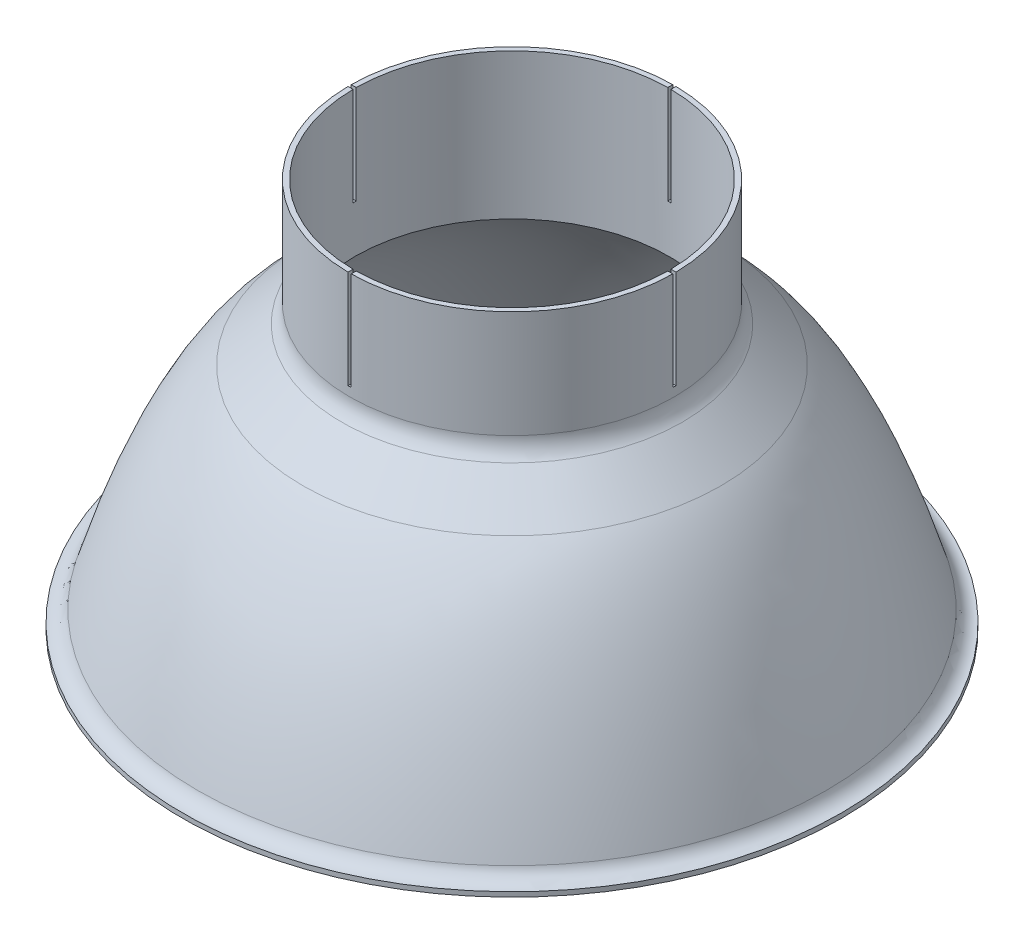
ISO-10303-21;
HEADER;
FILE_DESCRIPTION(('STEP AP214'),'2;1');
FILE_NAME('part.step','',(''),(''),'','','');
FILE_SCHEMA(('AUTOMOTIVE_DESIGN { 1 0 10303 214 1 1 1 1 }'));
ENDSEC;
DATA;
#1=APPLICATION_CONTEXT('core data for automotive mechanical design processes');
#2=APPLICATION_PROTOCOL_DEFINITION('international standard','automotive_design',2000,#1);
#3=PRODUCT_CONTEXT('',#1,'mechanical');
#4=PRODUCT('Part','Part','',(#3));
#5=PRODUCT_RELATED_PRODUCT_CATEGORY('part','',(#4));
#6=PRODUCT_DEFINITION_FORMATION('','',#4);
#7=PRODUCT_DEFINITION_CONTEXT('part definition',#1,'design');
#8=PRODUCT_DEFINITION('design','',#6,#7);
#9=PRODUCT_DEFINITION_SHAPE('','',#8);
#10=(LENGTH_UNIT() NAMED_UNIT(*) SI_UNIT(.MILLI.,.METRE.));
#11=(NAMED_UNIT(*) PLANE_ANGLE_UNIT() SI_UNIT($,.RADIAN.));
#12=(NAMED_UNIT(*) SI_UNIT($,.STERADIAN.) SOLID_ANGLE_UNIT());
#13=UNCERTAINTY_MEASURE_WITH_UNIT(LENGTH_MEASURE(1.E-05),#10,'distance_accuracy_value','');
#14=(GEOMETRIC_REPRESENTATION_CONTEXT(3) GLOBAL_UNCERTAINTY_ASSIGNED_CONTEXT((#13)) GLOBAL_UNIT_ASSIGNED_CONTEXT((#10,
#11,#12)) REPRESENTATION_CONTEXT('',''));
#15=CARTESIAN_POINT('',(0.,0.,0.));
#16=DIRECTION('',(0.,0.,1.));
#17=DIRECTION('',(1.,0.,0.));
#18=AXIS2_PLACEMENT_3D('',#15,#16,#17);
#19=CARTESIAN_POINT('',(50.8000000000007,27.1785255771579,0.));
#20=DIRECTION('',(0.,-1.,0.));
#21=DIRECTION('',(1.,0.,0.));
#22=AXIS2_PLACEMENT_3D('',#19,#20,#21);
#23=PLANE('',#22);
#24=CARTESIAN_POINT('',(0.,27.1785255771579,0.));
#25=DIRECTION('',(0.,1.,0.));
#26=DIRECTION('',(-1.,0.,0.));
#27=AXIS2_PLACEMENT_3D('',#24,#25,#26);
#28=CIRCLE('',#27,50.8000000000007);
#29=CARTESIAN_POINT('',(-50.7974599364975,27.1785255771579,0.507999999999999));
#30=VERTEX_POINT('',#29);
#31=CARTESIAN_POINT('',(-0.508000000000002,27.1785255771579,50.7974599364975));
#32=VERTEX_POINT('',#31);
#33=EDGE_CURVE('E235',#30,#32,#28,.T.);
#34=ORIENTED_EDGE('',*,*,#33,.F.);
#35=DIRECTION('',(-1.,0.,0.));
#36=VECTOR('',#35,1.);
#37=CARTESIAN_POINT('',(50.8000000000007,27.1785255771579,0.507999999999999));
#38=LINE('',#37,#36);
#39=CARTESIAN_POINT('',(-52.4231387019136,27.1785255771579,0.508000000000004));
#40=VERTEX_POINT('',#39);
#41=EDGE_CURVE('E184',#30,#40,#38,.T.);
#42=ORIENTED_EDGE('',*,*,#41,.T.);
#43=CARTESIAN_POINT('',(0.,27.1785255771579,0.));
#44=DIRECTION('',(0.,1.,0.));
#45=DIRECTION('',(-1.,0.,0.));
#46=AXIS2_PLACEMENT_3D('',#43,#44,#45);
#47=CIRCLE('',#46,52.4256000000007);
#48=CARTESIAN_POINT('',(-0.508000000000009,27.1785255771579,52.4231387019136));
#49=VERTEX_POINT('',#48);
#50=EDGE_CURVE('E244',#40,#49,#47,.T.);
#51=ORIENTED_EDGE('',*,*,#50,.T.);
#52=DIRECTION('',(0.,0.,-1.));
#53=VECTOR('',#52,1.);
#54=CARTESIAN_POINT('',(-0.508000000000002,27.1785255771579,0.));
#55=LINE('',#54,#53);
#56=EDGE_CURVE('E230',#49,#32,#55,.T.);
#57=ORIENTED_EDGE('',*,*,#56,.T.);
#58=EDGE_LOOP('',(#34,#42,#51,#57));
#59=FACE_BOUND('',#58,.T.);
#60=ADVANCED_FACE('F42',(#59),#23,.F.);
#61=CARTESIAN_POINT('',(0.508000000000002,27.1785255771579,52.4231387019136));
#62=VERTEX_POINT('',#61);
#63=CARTESIAN_POINT('',(52.4231387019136,27.1785255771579,0.508000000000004));
#64=VERTEX_POINT('',#63);
#65=EDGE_CURVE('E245',#62,#64,#47,.T.);
#66=ORIENTED_EDGE('',*,*,#65,.T.);
#67=DIRECTION('',(-1.,0.,0.));
#68=VECTOR('',#67,1.);
#69=CARTESIAN_POINT('',(50.8000000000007,27.1785255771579,0.507999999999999));
#70=LINE('',#69,#68);
#71=CARTESIAN_POINT('',(50.7974599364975,27.1785255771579,0.507999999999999));
#72=VERTEX_POINT('',#71);
#73=EDGE_CURVE('E199',#64,#72,#70,.T.);
#74=ORIENTED_EDGE('',*,*,#73,.T.);
#75=CARTESIAN_POINT('',(0.508000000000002,27.1785255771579,50.7974599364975));
#76=VERTEX_POINT('',#75);
#77=EDGE_CURVE('E239',#76,#72,#28,.T.);
#78=ORIENTED_EDGE('',*,*,#77,.F.);
#79=DIRECTION('',(0.,0.,1.));
#80=VECTOR('',#79,1.);
#81=CARTESIAN_POINT('',(0.508000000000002,27.1785255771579,0.));
#82=LINE('',#81,#80);
#83=EDGE_CURVE('E216',#76,#62,#82,.T.);
#84=ORIENTED_EDGE('',*,*,#83,.T.);
#85=EDGE_LOOP('',(#66,#74,#78,#84));
#86=FACE_BOUND('',#85,.T.);
#87=ADVANCED_FACE('F273',(#86),#23,.F.);
#88=CARTESIAN_POINT('',(-0.508000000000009,27.1785255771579,-52.4231387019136));
#89=VERTEX_POINT('',#88);
#90=CARTESIAN_POINT('',(-52.4231387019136,27.1785255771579,-0.508000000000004));
#91=VERTEX_POINT('',#90);
#92=EDGE_CURVE('E240',#89,#91,#47,.T.);
#93=ORIENTED_EDGE('',*,*,#92,.T.);
#94=DIRECTION('',(1.,0.,0.));
#95=VECTOR('',#94,1.);
#96=CARTESIAN_POINT('',(50.8000000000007,27.1785255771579,-0.507999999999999));
#97=LINE('',#96,#95);
#98=CARTESIAN_POINT('',(-50.7974599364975,27.1785255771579,-0.507999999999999));
#99=VERTEX_POINT('',#98);
#100=EDGE_CURVE('E185',#91,#99,#97,.T.);
#101=ORIENTED_EDGE('',*,*,#100,.T.);
#102=CARTESIAN_POINT('',(-0.508000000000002,27.1785255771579,-50.7974599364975));
#103=VERTEX_POINT('',#102);
#104=EDGE_CURVE('E182',#103,#99,#28,.T.);
#105=ORIENTED_EDGE('',*,*,#104,.F.);
#106=EDGE_CURVE('E226',#103,#89,#55,.T.);
#107=ORIENTED_EDGE('',*,*,#106,.T.);
#108=EDGE_LOOP('',(#93,#101,#105,#107));
#109=FACE_BOUND('',#108,.T.);
#110=ADVANCED_FACE('F269',(#109),#23,.F.);
#111=CARTESIAN_POINT('',(0.,-24.8281954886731,0.));
#112=DIRECTION('',(0.,-1.,0.));
#113=DIRECTION('',(1.,0.,0.));
#114=AXIS2_PLACEMENT_3D('',#111,#112,#113);
#115=CONICAL_SURFACE('',#114,67.4472420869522,0.823919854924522);
#116=CARTESIAN_POINT('',(0.,-13.277729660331,0.));
#117=DIRECTION('',(0.,-1.,0.));
#118=DIRECTION('',(1.,0.,0.));
#119=AXIS2_PLACEMENT_3D('',#116,#117,#118);
#120=CIRCLE('',#119,54.9707594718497);
#121=CARTESIAN_POINT('',(54.9707594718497,-13.2777296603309,0.));
#122=VERTEX_POINT('',#121);
#123=EDGE_CURVE('E358',#122,#122,#120,.T.);
#124=ORIENTED_EDGE('',*,*,#123,.T.);
#125=EDGE_LOOP('',(#124));
#126=FACE_BOUND('',#125,.T.);
#127=CARTESIAN_POINT('',(0.,-24.8281954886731,0.));
#128=DIRECTION('',(0.,1.,0.));
#129=DIRECTION('',(-1.,0.,0.));
#130=AXIS2_PLACEMENT_3D('',#127,#128,#129);
#131=CIRCLE('',#130,67.4472420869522);
#132=CARTESIAN_POINT('',(-67.4472420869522,-24.8281954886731,0.));
#133=VERTEX_POINT('',#132);
#134=EDGE_CURVE('E347',#133,#133,#131,.T.);
#135=ORIENTED_EDGE('',*,*,#134,.T.);
#136=EDGE_LOOP('',(#135));
#137=FACE_BOUND('',#136,.T.);
#138=ADVANCED_FACE('F265',(#126,#137),#115,.T.);
#139=CARTESIAN_POINT('',(0.,0.,0.));
#140=DIRECTION('',(0.,1.,0.));
#141=DIRECTION('',(-1.,0.,0.));
#142=AXIS2_PLACEMENT_3D('',#139,#140,#141);
#143=CYLINDRICAL_SURFACE('',#142,50.8000000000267);
#144=CARTESIAN_POINT('',(0.,-4.5714744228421,0.));
#145=DIRECTION('',(0.,-1.,0.));
#146=DIRECTION('',(0.,0.,-1.));
#147=AXIS2_PLACEMENT_3D('',#144,#145,#146);
#148=CIRCLE('',#147,50.8000000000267);
#149=CARTESIAN_POINT('',(-50.7974599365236,-4.5714744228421,-0.508000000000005));
#150=VERTEX_POINT('',#149);
#151=CARTESIAN_POINT('',(-50.7974599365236,-4.5714744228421,0.508000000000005));
#152=VERTEX_POINT('',#151);
#153=EDGE_CURVE('E158',#150,#152,#148,.F.);
#154=ORIENTED_EDGE('',*,*,#153,.T.);
#155=DIRECTION('',(0.,1.,0.));
#156=VECTOR('',#155,1.);
#157=CARTESIAN_POINT('',(-50.7974599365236,0.,0.508000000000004));
#158=LINE('',#157,#156);
#159=EDGE_CURVE('E191',#152,#30,#158,.T.);
#160=ORIENTED_EDGE('',*,*,#159,.T.);
#161=ORIENTED_EDGE('',*,*,#33,.T.);
#162=DIRECTION('',(0.,1.,0.));
#163=VECTOR('',#162,1.);
#164=CARTESIAN_POINT('',(-0.508000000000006,0.,50.7974599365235));
#165=LINE('',#164,#163);
#166=CARTESIAN_POINT('',(-0.508000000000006,-4.5714744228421,50.7974599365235));
#167=VERTEX_POINT('',#166);
#168=EDGE_CURVE('E232',#32,#167,#165,.F.);
#169=ORIENTED_EDGE('',*,*,#168,.T.);
#170=CARTESIAN_POINT('',(0.,-4.5714744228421,0.));
#171=DIRECTION('',(0.,-1.,0.));
#172=DIRECTION('',(0.,0.,-1.));
#173=AXIS2_PLACEMENT_3D('',#170,#171,#172);
#174=CIRCLE('',#173,50.8000000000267);
#175=CARTESIAN_POINT('',(0.508000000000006,-4.5714744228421,50.7974599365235));
#176=VERTEX_POINT('',#175);
#177=EDGE_CURVE('E215',#167,#176,#174,.F.);
#178=ORIENTED_EDGE('',*,*,#177,.T.);
#179=DIRECTION('',(0.,1.,0.));
#180=VECTOR('',#179,1.);
#181=CARTESIAN_POINT('',(0.508000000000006,0.,50.7974599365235));
#182=LINE('',#181,#180);
#183=EDGE_CURVE('E219',#176,#76,#182,.T.);
#184=ORIENTED_EDGE('',*,*,#183,.T.);
#185=ORIENTED_EDGE('',*,*,#77,.T.);
#186=DIRECTION('',(0.,1.,0.));
#187=VECTOR('',#186,1.);
#188=CARTESIAN_POINT('',(50.7974599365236,0.,0.508000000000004));
#189=LINE('',#188,#187);
#190=CARTESIAN_POINT('',(50.7974599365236,-4.5714744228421,0.508000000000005));
#191=VERTEX_POINT('',#190);
#192=EDGE_CURVE('E202',#72,#191,#189,.F.);
#193=ORIENTED_EDGE('',*,*,#192,.T.);
#194=CARTESIAN_POINT('',(50.7974599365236,-4.5714744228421,-0.508000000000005));
#195=VERTEX_POINT('',#194);
#196=EDGE_CURVE('E166',#191,#195,#148,.F.);
#197=ORIENTED_EDGE('',*,*,#196,.T.);
#198=DIRECTION('',(0.,1.,0.));
#199=VECTOR('',#198,1.);
#200=CARTESIAN_POINT('',(50.7974599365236,0.,-0.508000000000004));
#201=LINE('',#200,#199);
#202=CARTESIAN_POINT('',(50.7974599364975,27.1785255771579,-0.507999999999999));
#203=VERTEX_POINT('',#202);
#204=EDGE_CURVE('E193',#195,#203,#201,.T.);
#205=ORIENTED_EDGE('',*,*,#204,.T.);
#206=CARTESIAN_POINT('',(0.508000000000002,27.1785255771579,-50.7974599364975));
#207=VERTEX_POINT('',#206);
#208=EDGE_CURVE('E238',#203,#207,#28,.T.);
#209=ORIENTED_EDGE('',*,*,#208,.T.);
#210=DIRECTION('',(0.,1.,0.));
#211=VECTOR('',#210,1.);
#212=CARTESIAN_POINT('',(0.508000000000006,0.,-50.7974599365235));
#213=LINE('',#212,#211);
#214=CARTESIAN_POINT('',(0.508000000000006,-4.5714744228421,-50.7974599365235));
#215=VERTEX_POINT('',#214);
#216=EDGE_CURVE('E223',#207,#215,#213,.F.);
#217=ORIENTED_EDGE('',*,*,#216,.T.);
#218=CARTESIAN_POINT('',(-0.508000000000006,-4.5714744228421,-50.7974599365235));
#219=VERTEX_POINT('',#218);
#220=EDGE_CURVE('E212',#215,#219,#174,.F.);
#221=ORIENTED_EDGE('',*,*,#220,.T.);
#222=DIRECTION('',(0.,1.,0.));
#223=VECTOR('',#222,1.);
#224=CARTESIAN_POINT('',(-0.508000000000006,0.,-50.7974599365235));
#225=LINE('',#224,#223);
#226=EDGE_CURVE('E229',#219,#103,#225,.T.);
#227=ORIENTED_EDGE('',*,*,#226,.T.);
#228=ORIENTED_EDGE('',*,*,#104,.T.);
#229=DIRECTION('',(0.,1.,0.));
#230=VECTOR('',#229,1.);
#231=CARTESIAN_POINT('',(-50.7974599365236,0.,-0.508000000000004));
#232=LINE('',#231,#230);
#233=EDGE_CURVE('E170',#99,#150,#232,.F.);
#234=ORIENTED_EDGE('',*,*,#233,.T.);
#235=EDGE_LOOP('',(#154,#160,#161,#169,#178,#184,#185,#193,#197,#205,#209,#217,#221,#227,#228,#234));
#236=FACE_BOUND('',#235,.T.);
#237=CARTESIAN_POINT('',(0.,-19.8294722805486,0.));
#238=DIRECTION('',(0.,1.,0.));
#239=DIRECTION('',(-1.,0.,0.));
#240=AXIS2_PLACEMENT_3D('',#237,#238,#239);
#241=CIRCLE('',#240,50.8000000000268);
#242=CARTESIAN_POINT('',(-50.8000000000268,-19.8294722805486,0.));
#243=VERTEX_POINT('',#242);
#244=EDGE_CURVE('E415',#243,#243,#241,.T.);
#245=ORIENTED_EDGE('',*,*,#244,.F.);
#246=EDGE_LOOP('',(#245));
#247=FACE_BOUND('',#246,.T.);
#248=ADVANCED_FACE('F178',(#236,#247),#143,.F.);
#249=CARTESIAN_POINT('',(-2509.29800428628,-200019.829472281,0.));
#250=CARTESIAN_POINT('',(50.8000000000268,199980.170527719,0.));
#251=CARTESIAN_POINT('',(2610.89800428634,-200019.829472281,0.));
#252=B_SPLINE_CURVE_WITH_KNOTS('',2,(#249,#250,#251),.UNSPECIFIED.,.F.,.F.,(3,3),(0.,1.),.UNSPECIFIED.);
#253=CARTESIAN_POINT('',(0.,0.,0.));
#254=DIRECTION('',(0.,1.,0.));
#255=AXIS1_PLACEMENT('',#253,#254);
#256=SURFACE_OF_REVOLUTION('',#252,#255);
#257=CARTESIAN_POINT('',(0.,-93.7055764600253,0.));
#258=DIRECTION('',(0.,1.,0.));
#259=DIRECTION('',(-1.,0.,0.));
#260=AXIS2_PLACEMENT_3D('',#257,#258,#259);
#261=CIRCLE('',#260,100.003226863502);
#262=CARTESIAN_POINT('',(-100.003226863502,-93.7055764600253,0.));
#263=VERTEX_POINT('',#262);
#264=EDGE_CURVE('E419',#263,#263,#261,.T.);
#265=ORIENTED_EDGE('',*,*,#264,.F.);
#266=EDGE_LOOP('',(#265));
#267=FACE_BOUND('',#266,.T.);
#268=ORIENTED_EDGE('',*,*,#244,.T.);
#269=EDGE_LOOP('',(#268));
#270=FACE_BOUND('',#269,.T.);
#271=ADVANCED_FACE('F258',(#267,#270),#256,.T.);
#272=CARTESIAN_POINT('',(0.,-91.5758321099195,0.));
#273=DIRECTION('',(0.,1.,0.));
#274=DIRECTION('',(-1.,0.,0.));
#275=AXIS2_PLACEMENT_3D('',#272,#273,#274);
#276=TOROIDAL_SURFACE('',#275,106.398629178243,6.74069594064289);
#277=CARTESIAN_POINT('',(0.,-98.3165280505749,0.));
#278=DIRECTION('',(0.,1.,0.));
#279=DIRECTION('',(-1.,0.,0.));
#280=AXIS2_PLACEMENT_3D('',#277,#278,#279);
#281=CIRCLE('',#280,106.398629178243);
#282=CARTESIAN_POINT('',(-106.398629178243,-98.3165280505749,0.));
#283=VERTEX_POINT('',#282);
#284=EDGE_CURVE('E424',#283,#283,#281,.T.);
#285=ORIENTED_EDGE('',*,*,#284,.F.);
#286=EDGE_LOOP('',(#285));
#287=FACE_BOUND('',#286,.T.);
#288=ORIENTED_EDGE('',*,*,#264,.T.);
#289=EDGE_LOOP('',(#288));
#290=FACE_BOUND('',#289,.T.);
#291=ADVANCED_FACE('F261',(#287,#290),#276,.T.);
#292=CARTESIAN_POINT('',(0.,0.,0.));
#293=DIRECTION('',(0.,1.,0.));
#294=DIRECTION('',(-1.,0.,0.));
#295=AXIS2_PLACEMENT_3D('',#292,#293,#294);
#296=CYLINDRICAL_SURFACE('',#295,106.398629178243);
#297=CARTESIAN_POINT('',(0.,-96.7903773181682,0.));
#298=DIRECTION('',(0.,1.,0.));
#299=DIRECTION('',(-1.,0.,0.));
#300=AXIS2_PLACEMENT_3D('',#297,#298,#299);
#301=CIRCLE('',#300,106.398629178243);
#302=CARTESIAN_POINT('',(-106.398629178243,-96.7903773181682,0.));
#303=VERTEX_POINT('',#302);
#304=EDGE_CURVE('E427',#303,#303,#301,.T.);
#305=ORIENTED_EDGE('',*,*,#304,.F.);
#306=EDGE_LOOP('',(#305));
#307=FACE_BOUND('',#306,.T.);
#308=ORIENTED_EDGE('',*,*,#284,.T.);
#309=EDGE_LOOP('',(#308));
#310=FACE_BOUND('',#309,.T.);
#311=ADVANCED_FACE('F440',(#307,#310),#296,.T.);
#312=CARTESIAN_POINT('',(0.,-91.5758321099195,0.));
#313=DIRECTION('',(0.,1.,0.));
#314=DIRECTION('',(-1.,0.,0.));
#315=AXIS2_PLACEMENT_3D('',#312,#313,#314);
#316=TOROIDAL_SURFACE('',#315,106.398629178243,5.21454520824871);
#317=CARTESIAN_POINT('',(0.,-93.0550488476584,0.));
#318=DIRECTION('',(0.,1.,0.));
#319=DIRECTION('',(-1.,0.,0.));
#320=AXIS2_PLACEMENT_3D('',#317,#318,#319);
#321=CIRCLE('',#320,101.398289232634);
#322=CARTESIAN_POINT('',(-101.398289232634,-93.0550488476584,0.));
#323=VERTEX_POINT('',#322);
#324=EDGE_CURVE('E430',#323,#323,#321,.T.);
#325=ORIENTED_EDGE('',*,*,#324,.F.);
#326=EDGE_LOOP('',(#325));
#327=FACE_BOUND('',#326,.T.);
#328=ORIENTED_EDGE('',*,*,#304,.T.);
#329=EDGE_LOOP('',(#328));
#330=FACE_BOUND('',#329,.T.);
#331=ADVANCED_FACE('F292',(#327,#330),#316,.F.);
#332=CARTESIAN_POINT('',(101.398289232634,-93.0550488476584,0.));
#333=CARTESIAN_POINT('',(101.096303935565,-92.0342186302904,0.));
#334=CARTESIAN_POINT('',(100.33146694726,-89.4837197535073,0.));
#335=CARTESIAN_POINT('',(98.6484347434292,-84.0662909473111,0.));
#336=CARTESIAN_POINT('',(96.3052377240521,-76.993349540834,0.));
#337=CARTESIAN_POINT('',(93.4307189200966,-69.0605757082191,0.));
#338=CARTESIAN_POINT('',(89.5073157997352,-59.2035584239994,0.));
#339=CARTESIAN_POINT('',(84.4311848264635,-48.2373448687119,0.));
#340=CARTESIAN_POINT('',(78.0429533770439,-37.2313189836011,0.));
#341=CARTESIAN_POINT('',(72.9073356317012,-30.4623725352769,0.));
#342=CARTESIAN_POINT('',(69.3223045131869,-26.6224111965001,0.));
#343=CARTESIAN_POINT('',(68.0427373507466,-25.3794925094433,0.));
#344=CARTESIAN_POINT('',(67.4472420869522,-24.8281954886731,0.));
#345=B_SPLINE_CURVE_WITH_KNOTS('',3,(#332,#333,#334,#335,#336,#337,#338,#339,#340,#341,#342,
#343,#344),.UNSPECIFIED.,.F.,.F.,(4,1,1,1,1,1,1,1,1,1,4),(0.502588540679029,0.502763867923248,
0.503027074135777,0.503553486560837,0.504079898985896,0.504606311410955,0.505659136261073,
0.506711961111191,0.50776478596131,0.508071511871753,0.50833471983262),.UNSPECIFIED.);
#346=CARTESIAN_POINT('',(0.,0.,0.));
#347=DIRECTION('',(0.,1.,0.));
#348=AXIS1_PLACEMENT('',#346,#347);
#349=SURFACE_OF_REVOLUTION('',#345,#348);
#350=ORIENTED_EDGE('',*,*,#134,.F.);
#351=EDGE_LOOP('',(#350));
#352=FACE_BOUND('',#351,.T.);
#353=ORIENTED_EDGE('',*,*,#324,.T.);
#354=EDGE_LOOP('',(#353));
#355=FACE_BOUND('',#354,.T.);
#356=ADVANCED_FACE('F285',(#352,#355),#349,.T.);
#357=ORIENTED_EDGE('',*,*,#208,.F.);
#358=DIRECTION('',(1.,0.,0.));
#359=VECTOR('',#358,1.);
#360=CARTESIAN_POINT('',(50.8000000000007,27.1785255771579,-0.507999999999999));
#361=LINE('',#360,#359);
#362=CARTESIAN_POINT('',(52.4231387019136,27.1785255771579,-0.508000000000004));
#363=VERTEX_POINT('',#362);
#364=EDGE_CURVE('E165',#203,#363,#361,.T.);
#365=ORIENTED_EDGE('',*,*,#364,.T.);
#366=CARTESIAN_POINT('',(0.508000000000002,27.1785255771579,-52.4231387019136));
#367=VERTEX_POINT('',#366);
#368=EDGE_CURVE('E243',#363,#367,#47,.T.);
#369=ORIENTED_EDGE('',*,*,#368,.T.);
#370=EDGE_CURVE('E220',#367,#207,#82,.T.);
#371=ORIENTED_EDGE('',*,*,#370,.T.);
#372=EDGE_LOOP('',(#357,#365,#369,#371));
#373=FACE_BOUND('',#372,.T.);
#374=ADVANCED_FACE('F276',(#373),#23,.F.);
#375=CARTESIAN_POINT('',(0.,0.,0.));
#376=DIRECTION('',(0.,1.,0.));
#377=DIRECTION('',(-1.,0.,0.));
#378=AXIS2_PLACEMENT_3D('',#375,#376,#377);
#379=CYLINDRICAL_SURFACE('',#378,52.4256000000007);
#380=CARTESIAN_POINT('',(0.,-4.5714744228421,0.));
#381=DIRECTION('',(0.,-1.,0.));
#382=DIRECTION('',(0.,0.,-1.));
#383=AXIS2_PLACEMENT_3D('',#380,#381,#382);
#384=CIRCLE('',#383,52.4256000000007);
#385=CARTESIAN_POINT('',(52.4231387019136,-4.5714744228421,-0.508000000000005));
#386=VERTEX_POINT('',#385);
#387=CARTESIAN_POINT('',(52.4231387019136,-4.5714744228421,0.508000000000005));
#388=VERTEX_POINT('',#387);
#389=EDGE_CURVE('E312',#386,#388,#384,.T.);
#390=ORIENTED_EDGE('',*,*,#389,.T.);
#391=DIRECTION('',(0.,1.,0.));
#392=VECTOR('',#391,1.);
#393=CARTESIAN_POINT('',(52.4231387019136,0.,0.508000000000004));
#394=LINE('',#393,#392);
#395=EDGE_CURVE('E11',#388,#64,#394,.T.);
#396=ORIENTED_EDGE('',*,*,#395,.T.);
#397=ORIENTED_EDGE('',*,*,#65,.F.);
#398=DIRECTION('',(0.,1.,0.));
#399=VECTOR('',#398,1.);
#400=CARTESIAN_POINT('',(0.508000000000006,0.,52.4231387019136));
#401=LINE('',#400,#399);
#402=CARTESIAN_POINT('',(0.508000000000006,-4.5714744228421,52.4231387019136));
#403=VERTEX_POINT('',#402);
#404=EDGE_CURVE('E362',#62,#403,#401,.F.);
#405=ORIENTED_EDGE('',*,*,#404,.T.);
#406=CARTESIAN_POINT('',(0.,-4.5714744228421,0.));
#407=DIRECTION('',(0.,-1.,0.));
#408=DIRECTION('',(0.,0.,-1.));
#409=AXIS2_PLACEMENT_3D('',#406,#407,#408);
#410=CIRCLE('',#409,52.4256000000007);
#411=CARTESIAN_POINT('',(-0.508000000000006,-4.5714744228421,52.4231387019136));
#412=VERTEX_POINT('',#411);
#413=EDGE_CURVE('E356',#403,#412,#410,.T.);
#414=ORIENTED_EDGE('',*,*,#413,.T.);
#415=DIRECTION('',(0.,1.,0.));
#416=VECTOR('',#415,1.);
#417=CARTESIAN_POINT('',(-0.508000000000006,0.,52.4231387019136));
#418=LINE('',#417,#416);
#419=EDGE_CURVE('E314',#412,#49,#418,.T.);
#420=ORIENTED_EDGE('',*,*,#419,.T.);
#421=ORIENTED_EDGE('',*,*,#50,.F.);
#422=DIRECTION('',(0.,1.,0.));
#423=VECTOR('',#422,1.);
#424=CARTESIAN_POINT('',(-52.4231387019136,0.,0.508000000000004));
#425=LINE('',#424,#423);
#426=CARTESIAN_POINT('',(-52.4231387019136,-4.5714744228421,0.508000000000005));
#427=VERTEX_POINT('',#426);
#428=EDGE_CURVE('E309',#40,#427,#425,.F.);
#429=ORIENTED_EDGE('',*,*,#428,.T.);
#430=CARTESIAN_POINT('',(-52.4231387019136,-4.5714744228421,-0.508000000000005));
#431=VERTEX_POINT('',#430);
#432=EDGE_CURVE('E307',#427,#431,#384,.T.);
#433=ORIENTED_EDGE('',*,*,#432,.T.);
#434=DIRECTION('',(0.,1.,0.));
#435=VECTOR('',#434,1.);
#436=CARTESIAN_POINT('',(-52.4231387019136,0.,-0.508000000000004));
#437=LINE('',#436,#435);
#438=EDGE_CURVE('E173',#431,#91,#437,.T.);
#439=ORIENTED_EDGE('',*,*,#438,.T.);
#440=ORIENTED_EDGE('',*,*,#92,.F.);
#441=DIRECTION('',(0.,1.,0.));
#442=VECTOR('',#441,1.);
#443=CARTESIAN_POINT('',(-0.508000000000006,0.,-52.4231387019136));
#444=LINE('',#443,#442);
#445=CARTESIAN_POINT('',(-0.508000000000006,-4.5714744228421,-52.4231387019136));
#446=VERTEX_POINT('',#445);
#447=EDGE_CURVE('E305',#89,#446,#444,.F.);
#448=ORIENTED_EDGE('',*,*,#447,.T.);
#449=CARTESIAN_POINT('',(0.508000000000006,-4.5714744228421,-52.4231387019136));
#450=VERTEX_POINT('',#449);
#451=EDGE_CURVE('E354',#446,#450,#410,.T.);
#452=ORIENTED_EDGE('',*,*,#451,.T.);
#453=DIRECTION('',(0.,1.,0.));
#454=VECTOR('',#453,1.);
#455=CARTESIAN_POINT('',(0.508000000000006,0.,-52.4231387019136));
#456=LINE('',#455,#454);
#457=EDGE_CURVE('E353',#450,#367,#456,.T.);
#458=ORIENTED_EDGE('',*,*,#457,.T.);
#459=ORIENTED_EDGE('',*,*,#368,.F.);
#460=DIRECTION('',(0.,1.,0.));
#461=VECTOR('',#460,1.);
#462=CARTESIAN_POINT('',(52.4231387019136,0.,-0.508000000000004));
#463=LINE('',#462,#461);
#464=EDGE_CURVE('E50',#363,#386,#463,.F.);
#465=ORIENTED_EDGE('',*,*,#464,.T.);
#466=EDGE_LOOP('',(#390,#396,#397,#405,#414,#420,#421,#429,#433,#439,#440,#448,#452,#458,#459,#465));
#467=FACE_BOUND('',#466,.T.);
#468=CARTESIAN_POINT('',(0.,-7.45307774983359,0.));
#469=DIRECTION('',(0.,1.,0.));
#470=DIRECTION('',(-1.,0.,0.));
#471=AXIS2_PLACEMENT_3D('',#468,#469,#470);
#472=CIRCLE('',#471,52.4256000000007);
#473=CARTESIAN_POINT('',(-52.4256000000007,-7.4530777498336,0.));
#474=VERTEX_POINT('',#473);
#475=EDGE_CURVE('E413',#474,#474,#472,.T.);
#476=ORIENTED_EDGE('',*,*,#475,.T.);
#477=EDGE_LOOP('',(#476));
#478=FACE_BOUND('',#477,.T.);
#479=ADVANCED_FACE('F284',(#467,#478),#379,.T.);
#480=CARTESIAN_POINT('',(0.,-7.45307774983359,0.));
#481=DIRECTION('',(0.,1.,0.));
#482=DIRECTION('',(-1.,0.,0.));
#483=AXIS2_PLACEMENT_3D('',#480,#481,#482);
#484=TOROIDAL_SURFACE('',#483,60.3631000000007,7.9375);
#485=ORIENTED_EDGE('',*,*,#123,.F.);
#486=EDGE_LOOP('',(#485));
#487=FACE_BOUND('',#486,.T.);
#488=ORIENTED_EDGE('',*,*,#475,.F.);
#489=EDGE_LOOP('',(#488));
#490=FACE_BOUND('',#489,.T.);
#491=ADVANCED_FACE('F44',(#487,#490),#484,.F.);
#492=CARTESIAN_POINT('',(-0.508000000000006,-4.5714744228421,-106.398629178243));
#493=DIRECTION('',(0.,-1.,0.));
#494=DIRECTION('',(0.,0.,-1.));
#495=AXIS2_PLACEMENT_3D('',#492,#493,#494);
#496=PLANE('',#495);
#497=DIRECTION('',(0.,0.,1.));
#498=VECTOR('',#497,1.);
#499=CARTESIAN_POINT('',(0.508000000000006,-4.5714744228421,-106.398629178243));
#500=LINE('',#499,#498);
#501=EDGE_CURVE('E209',#450,#215,#500,.T.);
#502=ORIENTED_EDGE('',*,*,#501,.F.);
#503=ORIENTED_EDGE('',*,*,#451,.F.);
#504=DIRECTION('',(0.,0.,1.));
#505=VECTOR('',#504,1.);
#506=CARTESIAN_POINT('',(-0.508000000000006,-4.5714744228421,-106.398629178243));
#507=LINE('',#506,#505);
#508=EDGE_CURVE('E210',#446,#219,#507,.T.);
#509=ORIENTED_EDGE('',*,*,#508,.T.);
#510=ORIENTED_EDGE('',*,*,#220,.F.);
#511=EDGE_LOOP('',(#502,#503,#509,#510));
#512=FACE_BOUND('',#511,.T.);
#513=ADVANCED_FACE('F387',(#512),#496,.F.);
#514=CARTESIAN_POINT('',(0.508,48.5020020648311,-106.398629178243));
#515=DIRECTION('',(1.,0.,0.));
#516=DIRECTION('',(0.,1.,0.));
#517=AXIS2_PLACEMENT_3D('',#514,#515,#516);
#518=PLANE('',#517);
#519=ORIENTED_EDGE('',*,*,#370,.F.);
#520=ORIENTED_EDGE('',*,*,#457,.F.);
#521=ORIENTED_EDGE('',*,*,#501,.T.);
#522=ORIENTED_EDGE('',*,*,#216,.F.);
#523=EDGE_LOOP('',(#519,#520,#521,#522));
#524=FACE_BOUND('',#523,.T.);
#525=ADVANCED_FACE('F351',(#524),#518,.F.);
#526=CARTESIAN_POINT('',(-0.508,48.5020020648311,-106.398629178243));
#527=DIRECTION('',(-1.,0.,0.));
#528=DIRECTION('',(0.,-1.,0.));
#529=AXIS2_PLACEMENT_3D('',#526,#527,#528);
#530=PLANE('',#529);
#531=ORIENTED_EDGE('',*,*,#508,.F.);
#532=ORIENTED_EDGE('',*,*,#447,.F.);
#533=ORIENTED_EDGE('',*,*,#106,.F.);
#534=ORIENTED_EDGE('',*,*,#226,.F.);
#535=EDGE_LOOP('',(#531,#532,#533,#534));
#536=FACE_BOUND('',#535,.T.);
#537=ADVANCED_FACE('F386',(#536),#530,.F.);
#538=ORIENTED_EDGE('',*,*,#56,.F.);
#539=ORIENTED_EDGE('',*,*,#419,.F.);
#540=EDGE_CURVE('E205',#167,#412,#507,.T.);
#541=ORIENTED_EDGE('',*,*,#540,.F.);
#542=ORIENTED_EDGE('',*,*,#168,.F.);
#543=EDGE_LOOP('',(#538,#539,#541,#542));
#544=FACE_BOUND('',#543,.T.);
#545=ADVANCED_FACE('F343',(#544),#530,.F.);
#546=EDGE_CURVE('E206',#176,#403,#500,.T.);
#547=ORIENTED_EDGE('',*,*,#546,.T.);
#548=ORIENTED_EDGE('',*,*,#404,.F.);
#549=ORIENTED_EDGE('',*,*,#83,.F.);
#550=ORIENTED_EDGE('',*,*,#183,.F.);
#551=EDGE_LOOP('',(#547,#548,#549,#550));
#552=FACE_BOUND('',#551,.T.);
#553=ADVANCED_FACE('F369',(#552),#518,.F.);
#554=ORIENTED_EDGE('',*,*,#540,.T.);
#555=ORIENTED_EDGE('',*,*,#413,.F.);
#556=ORIENTED_EDGE('',*,*,#546,.F.);
#557=ORIENTED_EDGE('',*,*,#177,.F.);
#558=EDGE_LOOP('',(#554,#555,#556,#557));
#559=FACE_BOUND('',#558,.T.);
#560=ADVANCED_FACE('F367',(#559),#496,.F.);
#561=CARTESIAN_POINT('',(-106.398629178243,-4.5714744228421,0.508000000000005));
#562=DIRECTION('',(0.,-1.,0.));
#563=DIRECTION('',(0.,0.,-1.));
#564=AXIS2_PLACEMENT_3D('',#561,#562,#563);
#565=PLANE('',#564);
#566=DIRECTION('',(1.,0.,0.));
#567=VECTOR('',#566,1.);
#568=CARTESIAN_POINT('',(-106.398629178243,-4.5714744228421,-0.508000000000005));
#569=LINE('',#568,#567);
#570=EDGE_CURVE('E65',#431,#150,#569,.T.);
#571=ORIENTED_EDGE('',*,*,#570,.F.);
#572=ORIENTED_EDGE('',*,*,#432,.F.);
#573=DIRECTION('',(1.,0.,0.));
#574=VECTOR('',#573,1.);
#575=CARTESIAN_POINT('',(-106.398629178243,-4.5714744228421,0.508000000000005));
#576=LINE('',#575,#574);
#577=EDGE_CURVE('E161',#427,#152,#576,.T.);
#578=ORIENTED_EDGE('',*,*,#577,.T.);
#579=ORIENTED_EDGE('',*,*,#153,.F.);
#580=EDGE_LOOP('',(#571,#572,#578,#579));
#581=FACE_BOUND('',#580,.T.);
#582=ADVANCED_FACE('F159',(#581),#565,.F.);
#583=CARTESIAN_POINT('',(-106.398629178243,37.9483203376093,-0.507999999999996));
#584=DIRECTION('',(0.,0.,-1.));
#585=DIRECTION('',(0.,1.,0.));
#586=AXIS2_PLACEMENT_3D('',#583,#584,#585);
#587=PLANE('',#586);
#588=ORIENTED_EDGE('',*,*,#100,.F.);
#589=ORIENTED_EDGE('',*,*,#438,.F.);
#590=ORIENTED_EDGE('',*,*,#570,.T.);
#591=ORIENTED_EDGE('',*,*,#233,.F.);
#592=EDGE_LOOP('',(#588,#589,#590,#591));
#593=FACE_BOUND('',#592,.T.);
#594=ADVANCED_FACE('F169',(#593),#587,.F.);
#595=CARTESIAN_POINT('',(-106.398629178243,37.9483203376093,0.507999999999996));
#596=DIRECTION('',(0.,0.,1.));
#597=DIRECTION('',(0.,-1.,0.));
#598=AXIS2_PLACEMENT_3D('',#595,#596,#597);
#599=PLANE('',#598);
#600=ORIENTED_EDGE('',*,*,#577,.F.);
#601=ORIENTED_EDGE('',*,*,#428,.F.);
#602=ORIENTED_EDGE('',*,*,#41,.F.);
#603=ORIENTED_EDGE('',*,*,#159,.F.);
#604=EDGE_LOOP('',(#600,#601,#602,#603));
#605=FACE_BOUND('',#604,.T.);
#606=ADVANCED_FACE('F374',(#605),#599,.F.);
#607=ORIENTED_EDGE('',*,*,#73,.F.);
#608=ORIENTED_EDGE('',*,*,#395,.F.);
#609=EDGE_CURVE('E57',#191,#388,#576,.T.);
#610=ORIENTED_EDGE('',*,*,#609,.F.);
#611=ORIENTED_EDGE('',*,*,#192,.F.);
#612=EDGE_LOOP('',(#607,#608,#610,#611));
#613=FACE_BOUND('',#612,.T.);
#614=ADVANCED_FACE('F372',(#613),#599,.F.);
#615=EDGE_CURVE('E175',#195,#386,#569,.T.);
#616=ORIENTED_EDGE('',*,*,#615,.T.);
#617=ORIENTED_EDGE('',*,*,#464,.F.);
#618=ORIENTED_EDGE('',*,*,#364,.F.);
#619=ORIENTED_EDGE('',*,*,#204,.F.);
#620=EDGE_LOOP('',(#616,#617,#618,#619));
#621=FACE_BOUND('',#620,.T.);
#622=ADVANCED_FACE('F326',(#621),#587,.F.);
#623=ORIENTED_EDGE('',*,*,#609,.T.);
#624=ORIENTED_EDGE('',*,*,#389,.F.);
#625=ORIENTED_EDGE('',*,*,#615,.F.);
#626=ORIENTED_EDGE('',*,*,#196,.F.);
#627=EDGE_LOOP('',(#623,#624,#625,#626));
#628=FACE_BOUND('',#627,.T.);
#629=ADVANCED_FACE('F323',(#628),#565,.F.);
#630=CLOSED_SHELL('',(#60,#87,#110,#138,#248,#271,#291,#311,#331,#356,#374,#479,#491,#513,#525,
#537,#545,#553,#560,#582,#594,#606,#614,#622,#629));
#631=MANIFOLD_SOLID_BREP('B2',#630);
#632=ADVANCED_BREP_SHAPE_REPRESENTATION('',(#18,#631),#14);
#633=SHAPE_DEFINITION_REPRESENTATION(#9,#632);
ENDSEC;
END-ISO-10303-21;
